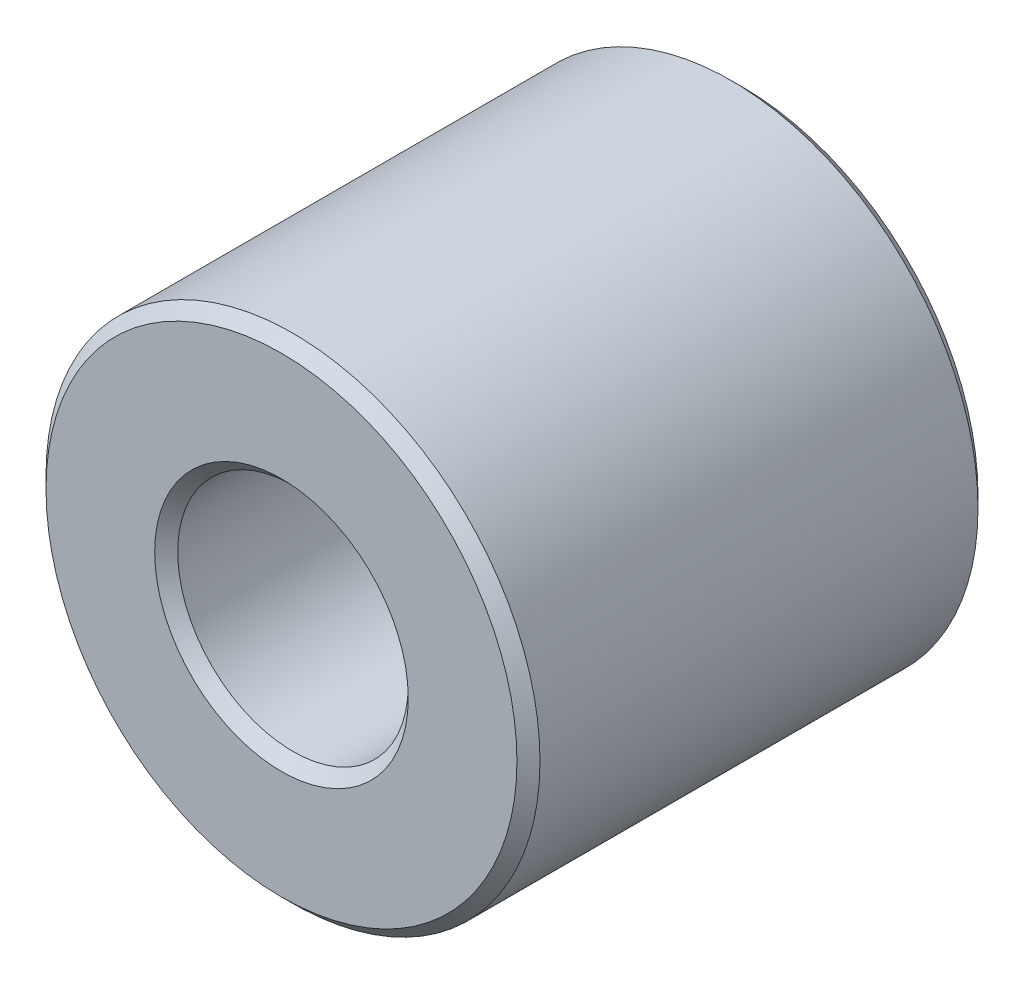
from build123d import *

# Parameters (mm, degrees)
SKETCH1_R           = 30
SKETCH1_R_2         = 14
BOSS_EXTRUDE1_DEPTH = 28
CHAMFER1_SIZE       = 1.4


with BuildPart() as part:
    # Sketch1 → Boss-Extrude1 (new, symmetric)
    with BuildSketch(Plane.XY):
        Circle(SKETCH1_R)
        Circle(SKETCH1_R_2, mode=Mode.SUBTRACT)
    extrude(amount=BOSS_EXTRUDE1_DEPTH, both=True)

    # Chamfer1
    chamfer1_edges = [part.edges().sort_by_distance(p)[0] for p in [
        (-30, 0, -28),
        (-30, 0, 28),
        (-14, 0, -28),
        (-14, 0, 28),
    ]]
    chamfer(chamfer1_edges, length=CHAMFER1_SIZE)


solid = part.part
